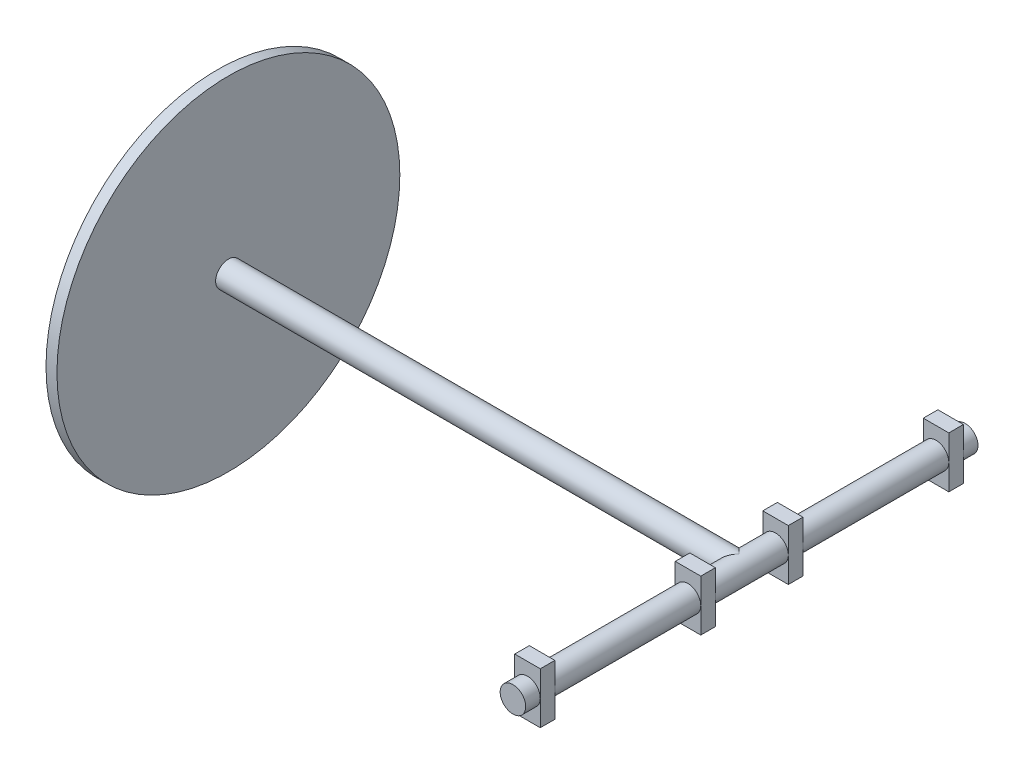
ISO-10303-21;
HEADER;
FILE_DESCRIPTION(('STEP AP214'),'2;1');
FILE_NAME('part.step','',(''),(''),'','','');
FILE_SCHEMA(('AUTOMOTIVE_DESIGN { 1 0 10303 214 1 1 1 1 }'));
ENDSEC;
DATA;
#1=APPLICATION_CONTEXT('core data for automotive mechanical design processes');
#2=APPLICATION_PROTOCOL_DEFINITION('international standard','automotive_design',2000,#1);
#3=PRODUCT_CONTEXT('',#1,'mechanical');
#4=PRODUCT('Part','Part','',(#3));
#5=PRODUCT_RELATED_PRODUCT_CATEGORY('part','',(#4));
#6=PRODUCT_DEFINITION_FORMATION('','',#4);
#7=PRODUCT_DEFINITION_CONTEXT('part definition',#1,'design');
#8=PRODUCT_DEFINITION('design','',#6,#7);
#9=PRODUCT_DEFINITION_SHAPE('','',#8);
#10=(LENGTH_UNIT() NAMED_UNIT(*) SI_UNIT(.MILLI.,.METRE.));
#11=(NAMED_UNIT(*) PLANE_ANGLE_UNIT() SI_UNIT($,.RADIAN.));
#12=(NAMED_UNIT(*) SI_UNIT($,.STERADIAN.) SOLID_ANGLE_UNIT());
#13=UNCERTAINTY_MEASURE_WITH_UNIT(LENGTH_MEASURE(1.E-05),#10,'distance_accuracy_value','');
#14=(GEOMETRIC_REPRESENTATION_CONTEXT(3) GLOBAL_UNCERTAINTY_ASSIGNED_CONTEXT((#13)) GLOBAL_UNIT_ASSIGNED_CONTEXT((#10,
#11,#12)) REPRESENTATION_CONTEXT('',''));
#15=CARTESIAN_POINT('',(0.,0.,0.));
#16=DIRECTION('',(0.,0.,1.));
#17=DIRECTION('',(1.,0.,0.));
#18=AXIS2_PLACEMENT_3D('',#15,#16,#17);
#19=CARTESIAN_POINT('',(3.5,7.,-58.));
#20=DIRECTION('',(0.,0.,-1.));
#21=DIRECTION('',(1.,0.,0.));
#22=AXIS2_PLACEMENT_3D('',#19,#20,#21);
#23=PLANE('',#22);
#24=DIRECTION('',(0.,1.,0.));
#25=VECTOR('',#24,1.);
#26=CARTESIAN_POINT('',(3.5,-7.,-58.));
#27=LINE('',#26,#25);
#28=CARTESIAN_POINT('',(3.5,0.,-58.));
#29=VERTEX_POINT('',#28);
#30=CARTESIAN_POINT('',(3.5,7.,-58.));
#31=VERTEX_POINT('',#30);
#32=EDGE_CURVE('E822',#29,#31,#27,.T.);
#33=ORIENTED_EDGE('',*,*,#32,.F.);
#34=CARTESIAN_POINT('',(0.,0.,-58.));
#35=DIRECTION('',(0.,0.,1.));
#36=DIRECTION('',(1.,0.,0.));
#37=AXIS2_PLACEMENT_3D('',#34,#35,#36);
#38=CIRCLE('',#37,3.5);
#39=CARTESIAN_POINT('',(-3.5,0.,-58.));
#40=VERTEX_POINT('',#39);
#41=EDGE_CURVE('E63',#29,#40,#38,.T.);
#42=ORIENTED_EDGE('',*,*,#41,.T.);
#43=DIRECTION('',(0.,-1.,0.));
#44=VECTOR('',#43,1.);
#45=CARTESIAN_POINT('',(-3.5,0.,-58.));
#46=LINE('',#45,#44);
#47=CARTESIAN_POINT('',(-3.5,7.,-58.));
#48=VERTEX_POINT('',#47);
#49=EDGE_CURVE('E813',#48,#40,#46,.T.);
#50=ORIENTED_EDGE('',*,*,#49,.F.);
#51=DIRECTION('',(-1.,0.,0.));
#52=VECTOR('',#51,1.);
#53=CARTESIAN_POINT('',(3.5,7.,-58.));
#54=LINE('',#53,#52);
#55=EDGE_CURVE('E810',#31,#48,#54,.T.);
#56=ORIENTED_EDGE('',*,*,#55,.F.);
#57=EDGE_LOOP('',(#33,#42,#50,#56));
#58=FACE_BOUND('',#57,.T.);
#59=ADVANCED_FACE('F44',(#58),#23,.T.);
#60=CARTESIAN_POINT('',(-3.5,-7.,-58.));
#61=VERTEX_POINT('',#60);
#62=EDGE_CURVE('E816',#40,#61,#46,.T.);
#63=ORIENTED_EDGE('',*,*,#62,.F.);
#64=EDGE_CURVE('E208',#40,#29,#38,.T.);
#65=ORIENTED_EDGE('',*,*,#64,.T.);
#66=CARTESIAN_POINT('',(3.5,-7.,-58.));
#67=VERTEX_POINT('',#66);
#68=EDGE_CURVE('E819',#67,#29,#27,.T.);
#69=ORIENTED_EDGE('',*,*,#68,.F.);
#70=DIRECTION('',(1.,0.,0.));
#71=VECTOR('',#70,1.);
#72=CARTESIAN_POINT('',(-3.5,-7.,-58.));
#73=LINE('',#72,#71);
#74=EDGE_CURVE('E817',#61,#67,#73,.T.);
#75=ORIENTED_EDGE('',*,*,#74,.F.);
#76=EDGE_LOOP('',(#63,#65,#69,#75));
#77=FACE_BOUND('',#76,.T.);
#78=ADVANCED_FACE('F365',(#77),#23,.T.);
#79=CARTESIAN_POINT('',(-3.5,-7.,-14.));
#80=DIRECTION('',(0.,0.,-1.));
#81=DIRECTION('',(1.,0.,0.));
#82=AXIS2_PLACEMENT_3D('',#79,#80,#81);
#83=PLANE('',#82);
#84=DIRECTION('',(0.,1.,0.));
#85=VECTOR('',#84,1.);
#86=CARTESIAN_POINT('',(3.5,7.,-14.));
#87=LINE('',#86,#85);
#88=CARTESIAN_POINT('',(3.5,0.,-14.));
#89=VERTEX_POINT('',#88);
#90=CARTESIAN_POINT('',(3.5,7.,-14.));
#91=VERTEX_POINT('',#90);
#92=EDGE_CURVE('E885',#89,#91,#87,.T.);
#93=ORIENTED_EDGE('',*,*,#92,.F.);
#94=CARTESIAN_POINT('',(0.,0.,-14.));
#95=DIRECTION('',(0.,0.,1.));
#96=DIRECTION('',(1.,0.,0.));
#97=AXIS2_PLACEMENT_3D('',#94,#95,#96);
#98=CIRCLE('',#97,3.5);
#99=CARTESIAN_POINT('',(-3.5,0.,-14.));
#100=VERTEX_POINT('',#99);
#101=EDGE_CURVE('E784',#89,#100,#98,.T.);
#102=ORIENTED_EDGE('',*,*,#101,.T.);
#103=DIRECTION('',(0.,-1.,0.));
#104=VECTOR('',#103,1.);
#105=CARTESIAN_POINT('',(-3.5,7.,-14.));
#106=LINE('',#105,#104);
#107=CARTESIAN_POINT('',(-3.5,7.,-14.));
#108=VERTEX_POINT('',#107);
#109=EDGE_CURVE('E879',#108,#100,#106,.T.);
#110=ORIENTED_EDGE('',*,*,#109,.F.);
#111=DIRECTION('',(-1.,0.,0.));
#112=VECTOR('',#111,1.);
#113=CARTESIAN_POINT('',(-3.5,7.,-14.));
#114=LINE('',#113,#112);
#115=EDGE_CURVE('E882',#91,#108,#114,.T.);
#116=ORIENTED_EDGE('',*,*,#115,.F.);
#117=EDGE_LOOP('',(#93,#102,#110,#116));
#118=FACE_BOUND('',#117,.T.);
#119=ADVANCED_FACE('F371',(#118),#83,.T.);
#120=CARTESIAN_POINT('',(-3.5,-7.,-14.));
#121=VERTEX_POINT('',#120);
#122=EDGE_CURVE('E878',#100,#121,#106,.T.);
#123=ORIENTED_EDGE('',*,*,#122,.F.);
#124=EDGE_CURVE('E781',#100,#89,#98,.T.);
#125=ORIENTED_EDGE('',*,*,#124,.T.);
#126=CARTESIAN_POINT('',(3.5,-7.,-14.));
#127=VERTEX_POINT('',#126);
#128=EDGE_CURVE('E886',#127,#89,#87,.T.);
#129=ORIENTED_EDGE('',*,*,#128,.F.);
#130=DIRECTION('',(1.,0.,0.));
#131=VECTOR('',#130,1.);
#132=CARTESIAN_POINT('',(-3.5,-7.,-14.));
#133=LINE('',#132,#131);
#134=EDGE_CURVE('E889',#121,#127,#133,.T.);
#135=ORIENTED_EDGE('',*,*,#134,.F.);
#136=EDGE_LOOP('',(#123,#125,#129,#135));
#137=FACE_BOUND('',#136,.T.);
#138=ADVANCED_FACE('F407',(#137),#83,.T.);
#139=CARTESIAN_POINT('',(3.5,7.,58.));
#140=DIRECTION('',(0.,0.,1.));
#141=DIRECTION('',(1.,0.,0.));
#142=AXIS2_PLACEMENT_3D('',#139,#140,#141);
#143=PLANE('',#142);
#144=CARTESIAN_POINT('',(0.,0.,58.));
#145=DIRECTION('',(0.,0.,1.));
#146=DIRECTION('',(1.,0.,0.));
#147=AXIS2_PLACEMENT_3D('',#144,#145,#146);
#148=CIRCLE('',#147,3.5);
#149=CARTESIAN_POINT('',(3.5,0.,58.));
#150=VERTEX_POINT('',#149);
#151=CARTESIAN_POINT('',(-3.5,0.,58.));
#152=VERTEX_POINT('',#151);
#153=EDGE_CURVE('E224',#150,#152,#148,.T.);
#154=ORIENTED_EDGE('',*,*,#153,.F.);
#155=DIRECTION('',(0.,1.,0.));
#156=VECTOR('',#155,1.);
#157=CARTESIAN_POINT('',(3.5,-7.,58.));
#158=LINE('',#157,#156);
#159=CARTESIAN_POINT('',(3.5,7.,58.));
#160=VERTEX_POINT('',#159);
#161=EDGE_CURVE('E250',#150,#160,#158,.T.);
#162=ORIENTED_EDGE('',*,*,#161,.T.);
#163=DIRECTION('',(-1.,0.,0.));
#164=VECTOR('',#163,1.);
#165=CARTESIAN_POINT('',(3.5,7.,58.));
#166=LINE('',#165,#164);
#167=CARTESIAN_POINT('',(-3.5,7.,58.));
#168=VERTEX_POINT('',#167);
#169=EDGE_CURVE('E253',#160,#168,#166,.T.);
#170=ORIENTED_EDGE('',*,*,#169,.T.);
#171=DIRECTION('',(0.,-1.,0.));
#172=VECTOR('',#171,1.);
#173=CARTESIAN_POINT('',(-3.5,7.,58.));
#174=LINE('',#173,#172);
#175=EDGE_CURVE('E256',#168,#152,#174,.T.);
#176=ORIENTED_EDGE('',*,*,#175,.T.);
#177=EDGE_LOOP('',(#154,#162,#170,#176));
#178=FACE_BOUND('',#177,.T.);
#179=ADVANCED_FACE('F363',(#178),#143,.T.);
#180=CARTESIAN_POINT('',(-3.5,-7.,14.));
#181=DIRECTION('',(0.,0.,1.));
#182=DIRECTION('',(1.,0.,0.));
#183=AXIS2_PLACEMENT_3D('',#180,#181,#182);
#184=PLANE('',#183);
#185=CARTESIAN_POINT('',(0.,0.,14.));
#186=DIRECTION('',(0.,0.,1.));
#187=DIRECTION('',(1.,0.,0.));
#188=AXIS2_PLACEMENT_3D('',#185,#186,#187);
#189=CIRCLE('',#188,3.5);
#190=CARTESIAN_POINT('',(3.5,0.,14.));
#191=VERTEX_POINT('',#190);
#192=CARTESIAN_POINT('',(-3.5,0.,14.));
#193=VERTEX_POINT('',#192);
#194=EDGE_CURVE('E273',#191,#193,#189,.T.);
#195=ORIENTED_EDGE('',*,*,#194,.F.);
#196=DIRECTION('',(0.,1.,0.));
#197=VECTOR('',#196,1.);
#198=CARTESIAN_POINT('',(3.5,7.,14.));
#199=LINE('',#198,#197);
#200=CARTESIAN_POINT('',(3.5,7.,14.));
#201=VERTEX_POINT('',#200);
#202=EDGE_CURVE('E299',#191,#201,#199,.T.);
#203=ORIENTED_EDGE('',*,*,#202,.T.);
#204=DIRECTION('',(-1.,0.,0.));
#205=VECTOR('',#204,1.);
#206=CARTESIAN_POINT('',(-3.5,7.,14.));
#207=LINE('',#206,#205);
#208=CARTESIAN_POINT('',(-3.5,7.,14.));
#209=VERTEX_POINT('',#208);
#210=EDGE_CURVE('E302',#201,#209,#207,.T.);
#211=ORIENTED_EDGE('',*,*,#210,.T.);
#212=DIRECTION('',(0.,-1.,0.));
#213=VECTOR('',#212,1.);
#214=CARTESIAN_POINT('',(-3.5,7.,14.));
#215=LINE('',#214,#213);
#216=EDGE_CURVE('E294',#209,#193,#215,.T.);
#217=ORIENTED_EDGE('',*,*,#216,.T.);
#218=EDGE_LOOP('',(#195,#203,#211,#217));
#219=FACE_BOUND('',#218,.T.);
#220=ADVANCED_FACE('F212',(#219),#184,.T.);
#221=CARTESIAN_POINT('',(0.,0.,10.));
#222=DIRECTION('',(0.,0.,-1.));
#223=DIRECTION('',(-1.,0.,0.));
#224=AXIS2_PLACEMENT_3D('',#221,#222,#223);
#225=CYLINDRICAL_SURFACE('',#224,3.5);
#226=CARTESIAN_POINT('',(0.,0.,0.));
#227=DIRECTION('',(-0.707106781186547,0.,-0.707106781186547));
#228=DIRECTION('',(0.707106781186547,0.,-0.707106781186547));
#229=AXIS2_PLACEMENT_3D('',#226,#227,#228);
#230=ELLIPSE('',#229,4.94974746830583,3.5);
#231=CARTESIAN_POINT('',(0.,3.5,0.));
#232=VERTEX_POINT('',#231);
#233=CARTESIAN_POINT('',(0.,-3.5,0.));
#234=VERTEX_POINT('',#233);
#235=EDGE_CURVE('E52',#232,#234,#230,.F.);
#236=ORIENTED_EDGE('',*,*,#235,.T.);
#237=CARTESIAN_POINT('',(0.,0.,0.));
#238=DIRECTION('',(0.707106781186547,0.,-0.707106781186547));
#239=DIRECTION('',(-0.707106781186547,0.,-0.707106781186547));
#240=AXIS2_PLACEMENT_3D('',#237,#238,#239);
#241=ELLIPSE('',#240,4.94974746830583,3.5);
#242=EDGE_CURVE('E13',#234,#232,#241,.T.);
#243=ORIENTED_EDGE('',*,*,#242,.T.);
#244=EDGE_LOOP('',(#236,#243));
#245=FACE_BOUND('',#244,.T.);
#246=CARTESIAN_POINT('',(0.,0.,10.));
#247=DIRECTION('',(0.,0.,1.));
#248=DIRECTION('',(1.,0.,0.));
#249=AXIS2_PLACEMENT_3D('',#246,#247,#248);
#250=CIRCLE('',#249,3.5);
#251=CARTESIAN_POINT('',(3.5,0.,10.));
#252=VERTEX_POINT('',#251);
#253=CARTESIAN_POINT('',(-3.5,0.,10.));
#254=VERTEX_POINT('',#253);
#255=EDGE_CURVE('E215',#252,#254,#250,.T.);
#256=ORIENTED_EDGE('',*,*,#255,.F.);
#257=EDGE_CURVE('E316',#254,#252,#250,.T.);
#258=ORIENTED_EDGE('',*,*,#257,.F.);
#259=EDGE_LOOP('',(#256,#258));
#260=FACE_BOUND('',#259,.T.);
#261=CARTESIAN_POINT('',(0.,0.,-10.));
#262=DIRECTION('',(0.,0.,1.));
#263=DIRECTION('',(1.,0.,0.));
#264=AXIS2_PLACEMENT_3D('',#261,#262,#263);
#265=CIRCLE('',#264,3.5);
#266=CARTESIAN_POINT('',(3.5,0.,-10.));
#267=VERTEX_POINT('',#266);
#268=CARTESIAN_POINT('',(-3.5,0.,-10.));
#269=VERTEX_POINT('',#268);
#270=EDGE_CURVE('E220',#267,#269,#265,.T.);
#271=ORIENTED_EDGE('',*,*,#270,.T.);
#272=EDGE_CURVE('E221',#269,#267,#265,.T.);
#273=ORIENTED_EDGE('',*,*,#272,.T.);
#274=EDGE_LOOP('',(#271,#273));
#275=FACE_BOUND('',#274,.T.);
#276=ADVANCED_FACE('F46',(#245,#260,#275),#225,.T.);
#277=CARTESIAN_POINT('',(-3.5,-7.,10.));
#278=DIRECTION('',(0.,0.,1.));
#279=DIRECTION('',(1.,0.,0.));
#280=AXIS2_PLACEMENT_3D('',#277,#278,#279);
#281=PLANE('',#280);
#282=DIRECTION('',(0.,1.,0.));
#283=VECTOR('',#282,1.);
#284=CARTESIAN_POINT('',(3.5,7.,10.));
#285=LINE('',#284,#283);
#286=CARTESIAN_POINT('',(3.5,7.,10.));
#287=VERTEX_POINT('',#286);
#288=EDGE_CURVE('E287',#252,#287,#285,.T.);
#289=ORIENTED_EDGE('',*,*,#288,.F.);
#290=ORIENTED_EDGE('',*,*,#255,.T.);
#291=DIRECTION('',(0.,-1.,0.));
#292=VECTOR('',#291,1.);
#293=CARTESIAN_POINT('',(-3.5,7.,10.));
#294=LINE('',#293,#292);
#295=CARTESIAN_POINT('',(-3.5,7.,10.));
#296=VERTEX_POINT('',#295);
#297=EDGE_CURVE('E282',#296,#254,#294,.T.);
#298=ORIENTED_EDGE('',*,*,#297,.F.);
#299=DIRECTION('',(-1.,0.,0.));
#300=VECTOR('',#299,1.);
#301=CARTESIAN_POINT('',(-3.5,7.,10.));
#302=LINE('',#301,#300);
#303=EDGE_CURVE('E291',#287,#296,#302,.T.);
#304=ORIENTED_EDGE('',*,*,#303,.F.);
#305=EDGE_LOOP('',(#289,#290,#298,#304));
#306=FACE_BOUND('',#305,.T.);
#307=ADVANCED_FACE('F211',(#306),#281,.F.);
#308=CARTESIAN_POINT('',(-3.5,-7.,10.));
#309=VERTEX_POINT('',#308);
#310=EDGE_CURVE('E281',#254,#309,#294,.T.);
#311=ORIENTED_EDGE('',*,*,#310,.F.);
#312=ORIENTED_EDGE('',*,*,#257,.T.);
#313=CARTESIAN_POINT('',(3.5,-7.,10.));
#314=VERTEX_POINT('',#313);
#315=EDGE_CURVE('E288',#314,#252,#285,.T.);
#316=ORIENTED_EDGE('',*,*,#315,.F.);
#317=DIRECTION('',(1.,0.,0.));
#318=VECTOR('',#317,1.);
#319=CARTESIAN_POINT('',(-3.5,-7.,10.));
#320=LINE('',#319,#318);
#321=EDGE_CURVE('E285',#309,#314,#320,.T.);
#322=ORIENTED_EDGE('',*,*,#321,.F.);
#323=EDGE_LOOP('',(#311,#312,#316,#322));
#324=FACE_BOUND('',#323,.T.);
#325=ADVANCED_FACE('F324',(#324),#281,.F.);
#326=CARTESIAN_POINT('',(-3.5,7.,14.));
#327=DIRECTION('',(1.,0.,0.));
#328=DIRECTION('',(0.,1.,0.));
#329=AXIS2_PLACEMENT_3D('',#326,#327,#328);
#330=PLANE('',#329);
#331=ORIENTED_EDGE('',*,*,#297,.T.);
#332=ORIENTED_EDGE('',*,*,#310,.T.);
#333=DIRECTION('',(0.,0.,-1.));
#334=VECTOR('',#333,1.);
#335=CARTESIAN_POINT('',(-3.5,-7.,14.));
#336=LINE('',#335,#334);
#337=CARTESIAN_POINT('',(-3.5,-7.,14.));
#338=VERTEX_POINT('',#337);
#339=EDGE_CURVE('E313',#338,#309,#336,.T.);
#340=ORIENTED_EDGE('',*,*,#339,.F.);
#341=EDGE_CURVE('E293',#193,#338,#215,.T.);
#342=ORIENTED_EDGE('',*,*,#341,.F.);
#343=ORIENTED_EDGE('',*,*,#216,.F.);
#344=DIRECTION('',(0.,0.,-1.));
#345=VECTOR('',#344,1.);
#346=CARTESIAN_POINT('',(-3.5,7.,14.));
#347=LINE('',#346,#345);
#348=EDGE_CURVE('E304',#209,#296,#347,.T.);
#349=ORIENTED_EDGE('',*,*,#348,.T.);
#350=EDGE_LOOP('',(#331,#332,#340,#342,#343,#349));
#351=FACE_BOUND('',#350,.T.);
#352=ADVANCED_FACE('F339',(#351),#330,.F.);
#353=CARTESIAN_POINT('',(-3.5,-7.,14.));
#354=DIRECTION('',(0.,1.,0.));
#355=DIRECTION('',(0.,0.,1.));
#356=AXIS2_PLACEMENT_3D('',#353,#354,#355);
#357=PLANE('',#356);
#358=ORIENTED_EDGE('',*,*,#321,.T.);
#359=DIRECTION('',(0.,0.,-1.));
#360=VECTOR('',#359,1.);
#361=CARTESIAN_POINT('',(3.5,-7.,14.));
#362=LINE('',#361,#360);
#363=CARTESIAN_POINT('',(3.5,-7.,14.));
#364=VERTEX_POINT('',#363);
#365=EDGE_CURVE('E310',#364,#314,#362,.T.);
#366=ORIENTED_EDGE('',*,*,#365,.F.);
#367=DIRECTION('',(1.,0.,0.));
#368=VECTOR('',#367,1.);
#369=CARTESIAN_POINT('',(-3.5,-7.,14.));
#370=LINE('',#369,#368);
#371=EDGE_CURVE('E297',#338,#364,#370,.T.);
#372=ORIENTED_EDGE('',*,*,#371,.F.);
#373=ORIENTED_EDGE('',*,*,#339,.T.);
#374=EDGE_LOOP('',(#358,#366,#372,#373));
#375=FACE_BOUND('',#374,.T.);
#376=ADVANCED_FACE('F335',(#375),#357,.F.);
#377=CARTESIAN_POINT('',(3.5,7.,14.));
#378=DIRECTION('',(-1.,0.,0.));
#379=DIRECTION('',(0.,-1.,0.));
#380=AXIS2_PLACEMENT_3D('',#377,#378,#379);
#381=PLANE('',#380);
#382=ORIENTED_EDGE('',*,*,#315,.T.);
#383=ORIENTED_EDGE('',*,*,#288,.T.);
#384=DIRECTION('',(0.,0.,-1.));
#385=VECTOR('',#384,1.);
#386=CARTESIAN_POINT('',(3.5,7.,14.));
#387=LINE('',#386,#385);
#388=EDGE_CURVE('E307',#201,#287,#387,.T.);
#389=ORIENTED_EDGE('',*,*,#388,.F.);
#390=ORIENTED_EDGE('',*,*,#202,.F.);
#391=EDGE_CURVE('E300',#364,#191,#199,.T.);
#392=ORIENTED_EDGE('',*,*,#391,.F.);
#393=ORIENTED_EDGE('',*,*,#365,.T.);
#394=EDGE_LOOP('',(#382,#383,#389,#390,#392,#393));
#395=FACE_BOUND('',#394,.T.);
#396=ADVANCED_FACE('F329',(#395),#381,.F.);
#397=CARTESIAN_POINT('',(-3.5,7.,14.));
#398=DIRECTION('',(0.,-1.,0.));
#399=DIRECTION('',(0.,0.,-1.));
#400=AXIS2_PLACEMENT_3D('',#397,#398,#399);
#401=PLANE('',#400);
#402=ORIENTED_EDGE('',*,*,#303,.T.);
#403=ORIENTED_EDGE('',*,*,#348,.F.);
#404=ORIENTED_EDGE('',*,*,#210,.F.);
#405=ORIENTED_EDGE('',*,*,#388,.T.);
#406=EDGE_LOOP('',(#402,#403,#404,#405));
#407=FACE_BOUND('',#406,.T.);
#408=ADVANCED_FACE('F344',(#407),#401,.F.);
#409=EDGE_CURVE('E277',#193,#191,#189,.T.);
#410=ORIENTED_EDGE('',*,*,#409,.F.);
#411=ORIENTED_EDGE('',*,*,#341,.T.);
#412=ORIENTED_EDGE('',*,*,#371,.T.);
#413=ORIENTED_EDGE('',*,*,#391,.T.);
#414=EDGE_LOOP('',(#410,#411,#412,#413));
#415=FACE_BOUND('',#414,.T.);
#416=ADVANCED_FACE('F351',(#415),#184,.T.);
#417=CARTESIAN_POINT('',(0.,0.,54.));
#418=DIRECTION('',(0.,0.,-1.));
#419=DIRECTION('',(-1.,0.,0.));
#420=AXIS2_PLACEMENT_3D('',#417,#418,#419);
#421=CYLINDRICAL_SURFACE('',#420,3.5);
#422=ORIENTED_EDGE('',*,*,#194,.T.);
#423=ORIENTED_EDGE('',*,*,#409,.T.);
#424=EDGE_LOOP('',(#422,#423));
#425=FACE_BOUND('',#424,.T.);
#426=CARTESIAN_POINT('',(0.,0.,54.));
#427=DIRECTION('',(0.,0.,1.));
#428=DIRECTION('',(1.,0.,0.));
#429=AXIS2_PLACEMENT_3D('',#426,#427,#428);
#430=CIRCLE('',#429,3.5);
#431=CARTESIAN_POINT('',(3.5,0.,54.));
#432=VERTEX_POINT('',#431);
#433=CARTESIAN_POINT('',(-3.5,0.,54.));
#434=VERTEX_POINT('',#433);
#435=EDGE_CURVE('E278',#432,#434,#430,.T.);
#436=ORIENTED_EDGE('',*,*,#435,.F.);
#437=EDGE_CURVE('E276',#434,#432,#430,.T.);
#438=ORIENTED_EDGE('',*,*,#437,.F.);
#439=EDGE_LOOP('',(#436,#438));
#440=FACE_BOUND('',#439,.T.);
#441=ADVANCED_FACE('F348',(#425,#440),#421,.T.);
#442=CARTESIAN_POINT('',(3.5,7.,54.));
#443=DIRECTION('',(0.,0.,1.));
#444=DIRECTION('',(1.,0.,0.));
#445=AXIS2_PLACEMENT_3D('',#442,#443,#444);
#446=PLANE('',#445);
#447=DIRECTION('',(0.,1.,0.));
#448=VECTOR('',#447,1.);
#449=CARTESIAN_POINT('',(3.5,0.,54.));
#450=LINE('',#449,#448);
#451=CARTESIAN_POINT('',(3.5,7.,54.));
#452=VERTEX_POINT('',#451);
#453=EDGE_CURVE('E236',#432,#452,#450,.T.);
#454=ORIENTED_EDGE('',*,*,#453,.F.);
#455=ORIENTED_EDGE('',*,*,#435,.T.);
#456=DIRECTION('',(0.,-1.,0.));
#457=VECTOR('',#456,1.);
#458=CARTESIAN_POINT('',(-3.5,0.,54.));
#459=LINE('',#458,#457);
#460=CARTESIAN_POINT('',(-3.5,7.,54.));
#461=VERTEX_POINT('',#460);
#462=EDGE_CURVE('E244',#461,#434,#459,.T.);
#463=ORIENTED_EDGE('',*,*,#462,.F.);
#464=DIRECTION('',(-1.,0.,0.));
#465=VECTOR('',#464,1.);
#466=CARTESIAN_POINT('',(3.5,7.,54.));
#467=LINE('',#466,#465);
#468=EDGE_CURVE('E240',#452,#461,#467,.T.);
#469=ORIENTED_EDGE('',*,*,#468,.F.);
#470=EDGE_LOOP('',(#454,#455,#463,#469));
#471=FACE_BOUND('',#470,.T.);
#472=ADVANCED_FACE('F358',(#471),#446,.F.);
#473=CARTESIAN_POINT('',(-3.5,-7.,54.));
#474=VERTEX_POINT('',#473);
#475=EDGE_CURVE('E243',#434,#474,#459,.T.);
#476=ORIENTED_EDGE('',*,*,#475,.F.);
#477=ORIENTED_EDGE('',*,*,#437,.T.);
#478=CARTESIAN_POINT('',(3.5,-7.,54.));
#479=VERTEX_POINT('',#478);
#480=EDGE_CURVE('E237',#479,#432,#450,.T.);
#481=ORIENTED_EDGE('',*,*,#480,.F.);
#482=DIRECTION('',(1.,0.,0.));
#483=VECTOR('',#482,1.);
#484=CARTESIAN_POINT('',(-3.5,-7.,54.));
#485=LINE('',#484,#483);
#486=EDGE_CURVE('E247',#474,#479,#485,.T.);
#487=ORIENTED_EDGE('',*,*,#486,.F.);
#488=EDGE_LOOP('',(#476,#477,#481,#487));
#489=FACE_BOUND('',#488,.T.);
#490=ADVANCED_FACE('F435',(#489),#446,.F.);
#491=CARTESIAN_POINT('',(3.5,0.,58.));
#492=DIRECTION('',(-1.,0.,0.));
#493=DIRECTION('',(0.,-1.,0.));
#494=AXIS2_PLACEMENT_3D('',#491,#492,#493);
#495=PLANE('',#494);
#496=ORIENTED_EDGE('',*,*,#480,.T.);
#497=ORIENTED_EDGE('',*,*,#453,.T.);
#498=DIRECTION('',(0.,0.,-1.));
#499=VECTOR('',#498,1.);
#500=CARTESIAN_POINT('',(3.5,7.,58.));
#501=LINE('',#500,#499);
#502=EDGE_CURVE('E270',#160,#452,#501,.T.);
#503=ORIENTED_EDGE('',*,*,#502,.F.);
#504=ORIENTED_EDGE('',*,*,#161,.F.);
#505=CARTESIAN_POINT('',(3.5,-7.,58.));
#506=VERTEX_POINT('',#505);
#507=EDGE_CURVE('E251',#506,#150,#158,.T.);
#508=ORIENTED_EDGE('',*,*,#507,.F.);
#509=DIRECTION('',(0.,0.,-1.));
#510=VECTOR('',#509,1.);
#511=CARTESIAN_POINT('',(3.5,-7.,58.));
#512=LINE('',#511,#510);
#513=EDGE_CURVE('E261',#506,#479,#512,.T.);
#514=ORIENTED_EDGE('',*,*,#513,.T.);
#515=EDGE_LOOP('',(#496,#497,#503,#504,#508,#514));
#516=FACE_BOUND('',#515,.T.);
#517=ADVANCED_FACE('F451',(#516),#495,.F.);
#518=CARTESIAN_POINT('',(3.5,7.,58.));
#519=DIRECTION('',(0.,-1.,0.));
#520=DIRECTION('',(0.,0.,-1.));
#521=AXIS2_PLACEMENT_3D('',#518,#519,#520);
#522=PLANE('',#521);
#523=ORIENTED_EDGE('',*,*,#468,.T.);
#524=DIRECTION('',(0.,0.,-1.));
#525=VECTOR('',#524,1.);
#526=CARTESIAN_POINT('',(-3.5,7.,58.));
#527=LINE('',#526,#525);
#528=EDGE_CURVE('E267',#168,#461,#527,.T.);
#529=ORIENTED_EDGE('',*,*,#528,.F.);
#530=ORIENTED_EDGE('',*,*,#169,.F.);
#531=ORIENTED_EDGE('',*,*,#502,.T.);
#532=EDGE_LOOP('',(#523,#529,#530,#531));
#533=FACE_BOUND('',#532,.T.);
#534=ADVANCED_FACE('F447',(#533),#522,.F.);
#535=CARTESIAN_POINT('',(-3.5,0.,58.));
#536=DIRECTION('',(1.,0.,0.));
#537=DIRECTION('',(0.,1.,0.));
#538=AXIS2_PLACEMENT_3D('',#535,#536,#537);
#539=PLANE('',#538);
#540=ORIENTED_EDGE('',*,*,#462,.T.);
#541=ORIENTED_EDGE('',*,*,#475,.T.);
#542=DIRECTION('',(0.,0.,-1.));
#543=VECTOR('',#542,1.);
#544=CARTESIAN_POINT('',(-3.5,-7.,58.));
#545=LINE('',#544,#543);
#546=CARTESIAN_POINT('',(-3.5,-7.,58.));
#547=VERTEX_POINT('',#546);
#548=EDGE_CURVE('E264',#547,#474,#545,.T.);
#549=ORIENTED_EDGE('',*,*,#548,.F.);
#550=EDGE_CURVE('E255',#152,#547,#174,.T.);
#551=ORIENTED_EDGE('',*,*,#550,.F.);
#552=ORIENTED_EDGE('',*,*,#175,.F.);
#553=ORIENTED_EDGE('',*,*,#528,.T.);
#554=EDGE_LOOP('',(#540,#541,#549,#551,#552,#553));
#555=FACE_BOUND('',#554,.T.);
#556=ADVANCED_FACE('F443',(#555),#539,.F.);
#557=CARTESIAN_POINT('',(-3.5,-7.,58.));
#558=DIRECTION('',(0.,1.,0.));
#559=DIRECTION('',(0.,0.,1.));
#560=AXIS2_PLACEMENT_3D('',#557,#558,#559);
#561=PLANE('',#560);
#562=ORIENTED_EDGE('',*,*,#486,.T.);
#563=ORIENTED_EDGE('',*,*,#513,.F.);
#564=DIRECTION('',(1.,0.,0.));
#565=VECTOR('',#564,1.);
#566=CARTESIAN_POINT('',(-3.5,-7.,58.));
#567=LINE('',#566,#565);
#568=EDGE_CURVE('E259',#547,#506,#567,.T.);
#569=ORIENTED_EDGE('',*,*,#568,.F.);
#570=ORIENTED_EDGE('',*,*,#548,.T.);
#571=EDGE_LOOP('',(#562,#563,#569,#570));
#572=FACE_BOUND('',#571,.T.);
#573=ADVANCED_FACE('F439',(#572),#561,.F.);
#574=EDGE_CURVE('E229',#152,#150,#148,.T.);
#575=ORIENTED_EDGE('',*,*,#574,.F.);
#576=ORIENTED_EDGE('',*,*,#550,.T.);
#577=ORIENTED_EDGE('',*,*,#568,.T.);
#578=ORIENTED_EDGE('',*,*,#507,.T.);
#579=EDGE_LOOP('',(#575,#576,#577,#578));
#580=FACE_BOUND('',#579,.T.);
#581=ADVANCED_FACE('F431',(#580),#143,.T.);
#582=CARTESIAN_POINT('',(0.,0.,62.));
#583=DIRECTION('',(0.,0.,-1.));
#584=DIRECTION('',(-1.,0.,0.));
#585=AXIS2_PLACEMENT_3D('',#582,#583,#584);
#586=CYLINDRICAL_SURFACE('',#585,3.5);
#587=ORIENTED_EDGE('',*,*,#153,.T.);
#588=ORIENTED_EDGE('',*,*,#574,.T.);
#589=EDGE_LOOP('',(#587,#588));
#590=FACE_BOUND('',#589,.T.);
#591=CARTESIAN_POINT('',(0.,0.,62.));
#592=DIRECTION('',(0.,0.,1.));
#593=DIRECTION('',(1.,0.,0.));
#594=AXIS2_PLACEMENT_3D('',#591,#592,#593);
#595=CIRCLE('',#594,3.5);
#596=CARTESIAN_POINT('',(3.5,0.,62.));
#597=VERTEX_POINT('',#596);
#598=EDGE_CURVE('E227',#597,#597,#595,.T.);
#599=ORIENTED_EDGE('',*,*,#598,.F.);
#600=EDGE_LOOP('',(#599));
#601=FACE_BOUND('',#600,.T.);
#602=ADVANCED_FACE('F427',(#590,#601),#586,.T.);
#603=CARTESIAN_POINT('',(0.,0.,62.));
#604=DIRECTION('',(0.,0.,1.));
#605=DIRECTION('',(1.,0.,0.));
#606=AXIS2_PLACEMENT_3D('',#603,#604,#605);
#607=PLANE('',#606);
#608=ORIENTED_EDGE('',*,*,#598,.T.);
#609=EDGE_LOOP('',(#608));
#610=FACE_BOUND('',#609,.T.);
#611=ADVANCED_FACE('F424',(#610),#607,.T.);
#612=CARTESIAN_POINT('',(-3.5,-7.,-10.));
#613=DIRECTION('',(0.,0.,-1.));
#614=DIRECTION('',(1.,0.,0.));
#615=AXIS2_PLACEMENT_3D('',#612,#613,#614);
#616=PLANE('',#615);
#617=ORIENTED_EDGE('',*,*,#270,.F.);
#618=DIRECTION('',(0.,1.,0.));
#619=VECTOR('',#618,1.);
#620=CARTESIAN_POINT('',(3.5,7.,-10.));
#621=LINE('',#620,#619);
#622=CARTESIAN_POINT('',(3.5,7.,-10.));
#623=VERTEX_POINT('',#622);
#624=EDGE_CURVE('E872',#267,#623,#621,.T.);
#625=ORIENTED_EDGE('',*,*,#624,.T.);
#626=DIRECTION('',(-1.,0.,0.));
#627=VECTOR('',#626,1.);
#628=CARTESIAN_POINT('',(-3.5,7.,-10.));
#629=LINE('',#628,#627);
#630=CARTESIAN_POINT('',(-3.5,7.,-10.));
#631=VERTEX_POINT('',#630);
#632=EDGE_CURVE('E869',#623,#631,#629,.T.);
#633=ORIENTED_EDGE('',*,*,#632,.T.);
#634=DIRECTION('',(0.,-1.,0.));
#635=VECTOR('',#634,1.);
#636=CARTESIAN_POINT('',(-3.5,7.,-10.));
#637=LINE('',#636,#635);
#638=EDGE_CURVE('E866',#631,#269,#637,.T.);
#639=ORIENTED_EDGE('',*,*,#638,.T.);
#640=EDGE_LOOP('',(#617,#625,#633,#639));
#641=FACE_BOUND('',#640,.T.);
#642=ADVANCED_FACE('F404',(#641),#616,.F.);
#643=CARTESIAN_POINT('',(-3.5,7.,-14.));
#644=DIRECTION('',(-1.,0.,0.));
#645=DIRECTION('',(0.,-1.,0.));
#646=AXIS2_PLACEMENT_3D('',#643,#644,#645);
#647=PLANE('',#646);
#648=ORIENTED_EDGE('',*,*,#638,.F.);
#649=DIRECTION('',(0.,0.,1.));
#650=VECTOR('',#649,1.);
#651=CARTESIAN_POINT('',(-3.5,7.,-14.));
#652=LINE('',#651,#650);
#653=EDGE_CURVE('E230',#108,#631,#652,.T.);
#654=ORIENTED_EDGE('',*,*,#653,.F.);
#655=ORIENTED_EDGE('',*,*,#109,.T.);
#656=ORIENTED_EDGE('',*,*,#122,.T.);
#657=DIRECTION('',(0.,0.,1.));
#658=VECTOR('',#657,1.);
#659=CARTESIAN_POINT('',(-3.5,-7.,-14.));
#660=LINE('',#659,#658);
#661=CARTESIAN_POINT('',(-3.5,-7.,-10.));
#662=VERTEX_POINT('',#661);
#663=EDGE_CURVE('E892',#121,#662,#660,.T.);
#664=ORIENTED_EDGE('',*,*,#663,.T.);
#665=EDGE_CURVE('E865',#269,#662,#637,.T.);
#666=ORIENTED_EDGE('',*,*,#665,.F.);
#667=EDGE_LOOP('',(#648,#654,#655,#656,#664,#666));
#668=FACE_BOUND('',#667,.T.);
#669=ADVANCED_FACE('F419',(#668),#647,.T.);
#670=CARTESIAN_POINT('',(-3.5,7.,-14.));
#671=DIRECTION('',(0.,1.,0.));
#672=DIRECTION('',(0.,0.,1.));
#673=AXIS2_PLACEMENT_3D('',#670,#671,#672);
#674=PLANE('',#673);
#675=ORIENTED_EDGE('',*,*,#632,.F.);
#676=DIRECTION('',(0.,0.,1.));
#677=VECTOR('',#676,1.);
#678=CARTESIAN_POINT('',(3.5,7.,-14.));
#679=LINE('',#678,#677);
#680=EDGE_CURVE('E896',#91,#623,#679,.T.);
#681=ORIENTED_EDGE('',*,*,#680,.F.);
#682=ORIENTED_EDGE('',*,*,#115,.T.);
#683=ORIENTED_EDGE('',*,*,#653,.T.);
#684=EDGE_LOOP('',(#675,#681,#682,#683));
#685=FACE_BOUND('',#684,.T.);
#686=ADVANCED_FACE('F415',(#685),#674,.T.);
#687=CARTESIAN_POINT('',(3.5,7.,-14.));
#688=DIRECTION('',(1.,0.,0.));
#689=DIRECTION('',(0.,1.,0.));
#690=AXIS2_PLACEMENT_3D('',#687,#688,#689);
#691=PLANE('',#690);
#692=CARTESIAN_POINT('',(3.5,-7.,-10.));
#693=VERTEX_POINT('',#692);
#694=EDGE_CURVE('E873',#693,#267,#621,.T.);
#695=ORIENTED_EDGE('',*,*,#694,.F.);
#696=DIRECTION('',(0.,0.,1.));
#697=VECTOR('',#696,1.);
#698=CARTESIAN_POINT('',(3.5,-7.,-14.));
#699=LINE('',#698,#697);
#700=EDGE_CURVE('E895',#127,#693,#699,.T.);
#701=ORIENTED_EDGE('',*,*,#700,.F.);
#702=ORIENTED_EDGE('',*,*,#128,.T.);
#703=ORIENTED_EDGE('',*,*,#92,.T.);
#704=ORIENTED_EDGE('',*,*,#680,.T.);
#705=ORIENTED_EDGE('',*,*,#624,.F.);
#706=EDGE_LOOP('',(#695,#701,#702,#703,#704,#705));
#707=FACE_BOUND('',#706,.T.);
#708=ADVANCED_FACE('F411',(#707),#691,.T.);
#709=CARTESIAN_POINT('',(-3.5,-7.,-14.));
#710=DIRECTION('',(0.,-1.,0.));
#711=DIRECTION('',(0.,0.,-1.));
#712=AXIS2_PLACEMENT_3D('',#709,#710,#711);
#713=PLANE('',#712);
#714=DIRECTION('',(1.,0.,0.));
#715=VECTOR('',#714,1.);
#716=CARTESIAN_POINT('',(-3.5,-7.,-10.));
#717=LINE('',#716,#715);
#718=EDGE_CURVE('E875',#662,#693,#717,.T.);
#719=ORIENTED_EDGE('',*,*,#718,.F.);
#720=ORIENTED_EDGE('',*,*,#663,.F.);
#721=ORIENTED_EDGE('',*,*,#134,.T.);
#722=ORIENTED_EDGE('',*,*,#700,.T.);
#723=EDGE_LOOP('',(#719,#720,#721,#722));
#724=FACE_BOUND('',#723,.T.);
#725=ADVANCED_FACE('F402',(#724),#713,.T.);
#726=ORIENTED_EDGE('',*,*,#272,.F.);
#727=ORIENTED_EDGE('',*,*,#665,.T.);
#728=ORIENTED_EDGE('',*,*,#718,.T.);
#729=ORIENTED_EDGE('',*,*,#694,.T.);
#730=EDGE_LOOP('',(#726,#727,#728,#729));
#731=FACE_BOUND('',#730,.T.);
#732=ADVANCED_FACE('F398',(#731),#616,.F.);
#733=CARTESIAN_POINT('',(0.,0.,-54.));
#734=DIRECTION('',(0.,0.,1.));
#735=DIRECTION('',(1.,0.,0.));
#736=AXIS2_PLACEMENT_3D('',#733,#734,#735);
#737=CYLINDRICAL_SURFACE('',#736,3.5);
#738=ORIENTED_EDGE('',*,*,#101,.F.);
#739=ORIENTED_EDGE('',*,*,#124,.F.);
#740=EDGE_LOOP('',(#738,#739));
#741=FACE_BOUND('',#740,.T.);
#742=CARTESIAN_POINT('',(0.,0.,-54.));
#743=DIRECTION('',(0.,0.,1.));
#744=DIRECTION('',(1.,0.,0.));
#745=AXIS2_PLACEMENT_3D('',#742,#743,#744);
#746=CIRCLE('',#745,3.5);
#747=CARTESIAN_POINT('',(3.5,0.,-54.));
#748=VERTEX_POINT('',#747);
#749=CARTESIAN_POINT('',(-3.5,0.,-54.));
#750=VERTEX_POINT('',#749);
#751=EDGE_CURVE('E796',#748,#750,#746,.T.);
#752=ORIENTED_EDGE('',*,*,#751,.T.);
#753=EDGE_CURVE('E792',#750,#748,#746,.T.);
#754=ORIENTED_EDGE('',*,*,#753,.T.);
#755=EDGE_LOOP('',(#752,#754));
#756=FACE_BOUND('',#755,.T.);
#757=ADVANCED_FACE('F395',(#741,#756),#737,.T.);
#758=CARTESIAN_POINT('',(3.5,7.,-54.));
#759=DIRECTION('',(0.,0.,-1.));
#760=DIRECTION('',(1.,0.,0.));
#761=AXIS2_PLACEMENT_3D('',#758,#759,#760);
#762=PLANE('',#761);
#763=ORIENTED_EDGE('',*,*,#751,.F.);
#764=DIRECTION('',(0.,1.,0.));
#765=VECTOR('',#764,1.);
#766=CARTESIAN_POINT('',(3.5,0.,-54.));
#767=LINE('',#766,#765);
#768=CARTESIAN_POINT('',(3.5,7.,-54.));
#769=VERTEX_POINT('',#768);
#770=EDGE_CURVE('E825',#748,#769,#767,.T.);
#771=ORIENTED_EDGE('',*,*,#770,.T.);
#772=DIRECTION('',(-1.,0.,0.));
#773=VECTOR('',#772,1.);
#774=CARTESIAN_POINT('',(3.5,7.,-54.));
#775=LINE('',#774,#773);
#776=CARTESIAN_POINT('',(-3.5,7.,-54.));
#777=VERTEX_POINT('',#776);
#778=EDGE_CURVE('E826',#769,#777,#775,.T.);
#779=ORIENTED_EDGE('',*,*,#778,.T.);
#780=DIRECTION('',(0.,-1.,0.));
#781=VECTOR('',#780,1.);
#782=CARTESIAN_POINT('',(-3.5,7.,-54.));
#783=LINE('',#782,#781);
#784=EDGE_CURVE('E829',#777,#750,#783,.T.);
#785=ORIENTED_EDGE('',*,*,#784,.T.);
#786=EDGE_LOOP('',(#763,#771,#779,#785));
#787=FACE_BOUND('',#786,.T.);
#788=ADVANCED_FACE('F393',(#787),#762,.F.);
#789=CARTESIAN_POINT('',(-3.5,-7.,-58.));
#790=DIRECTION('',(0.,-1.,0.));
#791=DIRECTION('',(0.,0.,-1.));
#792=AXIS2_PLACEMENT_3D('',#789,#790,#791);
#793=PLANE('',#792);
#794=DIRECTION('',(1.,0.,0.));
#795=VECTOR('',#794,1.);
#796=CARTESIAN_POINT('',(-3.5,-7.,-54.));
#797=LINE('',#796,#795);
#798=CARTESIAN_POINT('',(-3.5,-7.,-54.));
#799=VERTEX_POINT('',#798);
#800=CARTESIAN_POINT('',(3.5,-7.,-54.));
#801=VERTEX_POINT('',#800);
#802=EDGE_CURVE('E833',#799,#801,#797,.T.);
#803=ORIENTED_EDGE('',*,*,#802,.F.);
#804=DIRECTION('',(0.,0.,1.));
#805=VECTOR('',#804,1.);
#806=CARTESIAN_POINT('',(-3.5,-7.,-58.));
#807=LINE('',#806,#805);
#808=EDGE_CURVE('E798',#61,#799,#807,.T.);
#809=ORIENTED_EDGE('',*,*,#808,.F.);
#810=ORIENTED_EDGE('',*,*,#74,.T.);
#811=DIRECTION('',(0.,0.,1.));
#812=VECTOR('',#811,1.);
#813=CARTESIAN_POINT('',(3.5,-7.,-58.));
#814=LINE('',#813,#812);
#815=EDGE_CURVE('E793',#67,#801,#814,.T.);
#816=ORIENTED_EDGE('',*,*,#815,.T.);
#817=EDGE_LOOP('',(#803,#809,#810,#816));
#818=FACE_BOUND('',#817,.T.);
#819=ADVANCED_FACE('F389',(#818),#793,.T.);
#820=CARTESIAN_POINT('',(-3.5,7.,-58.));
#821=DIRECTION('',(-1.,0.,0.));
#822=DIRECTION('',(0.,-1.,0.));
#823=AXIS2_PLACEMENT_3D('',#820,#821,#822);
#824=PLANE('',#823);
#825=ORIENTED_EDGE('',*,*,#784,.F.);
#826=DIRECTION('',(0.,0.,1.));
#827=VECTOR('',#826,1.);
#828=CARTESIAN_POINT('',(-3.5,7.,-58.));
#829=LINE('',#828,#827);
#830=EDGE_CURVE('E803',#48,#777,#829,.T.);
#831=ORIENTED_EDGE('',*,*,#830,.F.);
#832=ORIENTED_EDGE('',*,*,#49,.T.);
#833=ORIENTED_EDGE('',*,*,#62,.T.);
#834=ORIENTED_EDGE('',*,*,#808,.T.);
#835=EDGE_CURVE('E832',#750,#799,#783,.T.);
#836=ORIENTED_EDGE('',*,*,#835,.F.);
#837=EDGE_LOOP('',(#825,#831,#832,#833,#834,#836));
#838=FACE_BOUND('',#837,.T.);
#839=ADVANCED_FACE('F385',(#838),#824,.T.);
#840=CARTESIAN_POINT('',(3.5,7.,-58.));
#841=DIRECTION('',(0.,1.,0.));
#842=DIRECTION('',(0.,0.,1.));
#843=AXIS2_PLACEMENT_3D('',#840,#841,#842);
#844=PLANE('',#843);
#845=ORIENTED_EDGE('',*,*,#778,.F.);
#846=DIRECTION('',(0.,0.,1.));
#847=VECTOR('',#846,1.);
#848=CARTESIAN_POINT('',(3.5,7.,-58.));
#849=LINE('',#848,#847);
#850=EDGE_CURVE('E807',#31,#769,#849,.T.);
#851=ORIENTED_EDGE('',*,*,#850,.F.);
#852=ORIENTED_EDGE('',*,*,#55,.T.);
#853=ORIENTED_EDGE('',*,*,#830,.T.);
#854=EDGE_LOOP('',(#845,#851,#852,#853));
#855=FACE_BOUND('',#854,.T.);
#856=ADVANCED_FACE('F381',(#855),#844,.T.);
#857=CARTESIAN_POINT('',(3.5,0.,-58.));
#858=DIRECTION('',(1.,0.,0.));
#859=DIRECTION('',(0.,1.,0.));
#860=AXIS2_PLACEMENT_3D('',#857,#858,#859);
#861=PLANE('',#860);
#862=EDGE_CURVE('E823',#801,#748,#767,.T.);
#863=ORIENTED_EDGE('',*,*,#862,.F.);
#864=ORIENTED_EDGE('',*,*,#815,.F.);
#865=ORIENTED_EDGE('',*,*,#68,.T.);
#866=ORIENTED_EDGE('',*,*,#32,.T.);
#867=ORIENTED_EDGE('',*,*,#850,.T.);
#868=ORIENTED_EDGE('',*,*,#770,.F.);
#869=EDGE_LOOP('',(#863,#864,#865,#866,#867,#868));
#870=FACE_BOUND('',#869,.T.);
#871=ADVANCED_FACE('F378',(#870),#861,.T.);
#872=ORIENTED_EDGE('',*,*,#753,.F.);
#873=ORIENTED_EDGE('',*,*,#835,.T.);
#874=ORIENTED_EDGE('',*,*,#802,.T.);
#875=ORIENTED_EDGE('',*,*,#862,.T.);
#876=EDGE_LOOP('',(#872,#873,#874,#875));
#877=FACE_BOUND('',#876,.T.);
#878=ADVANCED_FACE('F376',(#877),#762,.F.);
#879=CARTESIAN_POINT('',(0.,0.,-62.));
#880=DIRECTION('',(0.,0.,1.));
#881=DIRECTION('',(1.,0.,0.));
#882=AXIS2_PLACEMENT_3D('',#879,#880,#881);
#883=CYLINDRICAL_SURFACE('',#882,3.5);
#884=ORIENTED_EDGE('',*,*,#41,.F.);
#885=ORIENTED_EDGE('',*,*,#64,.F.);
#886=EDGE_LOOP('',(#884,#885));
#887=FACE_BOUND('',#886,.T.);
#888=CARTESIAN_POINT('',(0.,0.,-62.));
#889=DIRECTION('',(0.,0.,1.));
#890=DIRECTION('',(1.,0.,0.));
#891=AXIS2_PLACEMENT_3D('',#888,#889,#890);
#892=CIRCLE('',#891,3.5);
#893=CARTESIAN_POINT('',(3.5,0.,-62.));
#894=VERTEX_POINT('',#893);
#895=EDGE_CURVE('E835',#894,#894,#892,.T.);
#896=ORIENTED_EDGE('',*,*,#895,.T.);
#897=EDGE_LOOP('',(#896));
#898=FACE_BOUND('',#897,.T.);
#899=ADVANCED_FACE('F613',(#887,#898),#883,.T.);
#900=CARTESIAN_POINT('',(0.,0.,-62.));
#901=DIRECTION('',(0.,0.,-1.));
#902=DIRECTION('',(1.,0.,0.));
#903=AXIS2_PLACEMENT_3D('',#900,#901,#902);
#904=PLANE('',#903);
#905=ORIENTED_EDGE('',*,*,#895,.F.);
#906=EDGE_LOOP('',(#905));
#907=FACE_BOUND('',#906,.T.);
#908=ADVANCED_FACE('F629',(#907),#904,.T.);
#909=CARTESIAN_POINT('',(-140.,0.,0.));
#910=DIRECTION('',(1.,0.,0.));
#911=DIRECTION('',(0.,0.,-1.));
#912=AXIS2_PLACEMENT_3D('',#909,#910,#911);
#913=CYLINDRICAL_SURFACE('',#912,3.5);
#914=CARTESIAN_POINT('',(-140.,0.,0.));
#915=DIRECTION('',(-1.,0.,0.));
#916=DIRECTION('',(0.,0.,1.));
#917=AXIS2_PLACEMENT_3D('',#914,#915,#916);
#918=CIRCLE('',#917,3.5);
#919=CARTESIAN_POINT('',(-140.,0.,3.5));
#920=VERTEX_POINT('',#919);
#921=EDGE_CURVE('E838',#920,#920,#918,.F.);
#922=ORIENTED_EDGE('',*,*,#921,.T.);
#923=EDGE_LOOP('',(#922));
#924=FACE_BOUND('',#923,.T.);
#925=ORIENTED_EDGE('',*,*,#242,.F.);
#926=ORIENTED_EDGE('',*,*,#235,.F.);
#927=EDGE_LOOP('',(#925,#926));
#928=FACE_BOUND('',#927,.T.);
#929=ADVANCED_FACE('F206',(#924,#928),#913,.T.);
#930=CARTESIAN_POINT('',(-143.,0.,0.));
#931=DIRECTION('',(1.,0.,0.));
#932=DIRECTION('',(0.,0.,-1.));
#933=AXIS2_PLACEMENT_3D('',#930,#931,#932);
#934=CYLINDRICAL_SURFACE('',#933,47.);
#935=CARTESIAN_POINT('',(-143.,0.,0.));
#936=DIRECTION('',(-1.,0.,0.));
#937=DIRECTION('',(0.,0.,1.));
#938=AXIS2_PLACEMENT_3D('',#935,#936,#937);
#939=CIRCLE('',#938,47.);
#940=CARTESIAN_POINT('',(-143.,0.,47.));
#941=VERTEX_POINT('',#940);
#942=EDGE_CURVE('E841',#941,#941,#939,.T.);
#943=ORIENTED_EDGE('',*,*,#942,.F.);
#944=EDGE_LOOP('',(#943));
#945=FACE_BOUND('',#944,.T.);
#946=CARTESIAN_POINT('',(-140.,0.,0.));
#947=DIRECTION('',(-1.,0.,0.));
#948=DIRECTION('',(0.,0.,1.));
#949=AXIS2_PLACEMENT_3D('',#946,#947,#948);
#950=CIRCLE('',#949,47.);
#951=CARTESIAN_POINT('',(-140.,0.,47.));
#952=VERTEX_POINT('',#951);
#953=EDGE_CURVE('E844',#952,#952,#950,.T.);
#954=ORIENTED_EDGE('',*,*,#953,.T.);
#955=EDGE_LOOP('',(#954));
#956=FACE_BOUND('',#955,.T.);
#957=ADVANCED_FACE('F645',(#945,#956),#934,.T.);
#958=CARTESIAN_POINT('',(-143.,0.,0.));
#959=DIRECTION('',(-1.,0.,0.));
#960=DIRECTION('',(0.,0.,1.));
#961=AXIS2_PLACEMENT_3D('',#958,#959,#960);
#962=PLANE('',#961);
#963=ORIENTED_EDGE('',*,*,#942,.T.);
#964=EDGE_LOOP('',(#963));
#965=FACE_BOUND('',#964,.T.);
#966=ADVANCED_FACE('F654',(#965),#962,.T.);
#967=CARTESIAN_POINT('',(-140.,0.,0.));
#968=DIRECTION('',(-1.,0.,0.));
#969=DIRECTION('',(0.,0.,1.));
#970=AXIS2_PLACEMENT_3D('',#967,#968,#969);
#971=PLANE('',#970);
#972=ORIENTED_EDGE('',*,*,#921,.F.);
#973=EDGE_LOOP('',(#972));
#974=FACE_BOUND('',#973,.T.);
#975=ORIENTED_EDGE('',*,*,#953,.F.);
#976=EDGE_LOOP('',(#975));
#977=FACE_BOUND('',#976,.T.);
#978=ADVANCED_FACE('F663',(#974,#977),#971,.F.);
#979=CLOSED_SHELL('',(#59,#78,#119,#138,#179,#220,#276,#307,#325,#352,#376,#396,#408,#416,#441,
#472,#490,#517,#534,#556,#573,#581,#602,#611,#642,#669,#686,#708,#725,#732,#757,#788,#819,#839,
#856,#871,#878,#899,#908,#929,#957,#966,#978));
#980=MANIFOLD_SOLID_BREP('B2',#979);
#981=ADVANCED_BREP_SHAPE_REPRESENTATION('',(#18,#980),#14);
#982=SHAPE_DEFINITION_REPRESENTATION(#9,#981);
ENDSEC;
END-ISO-10303-21;
